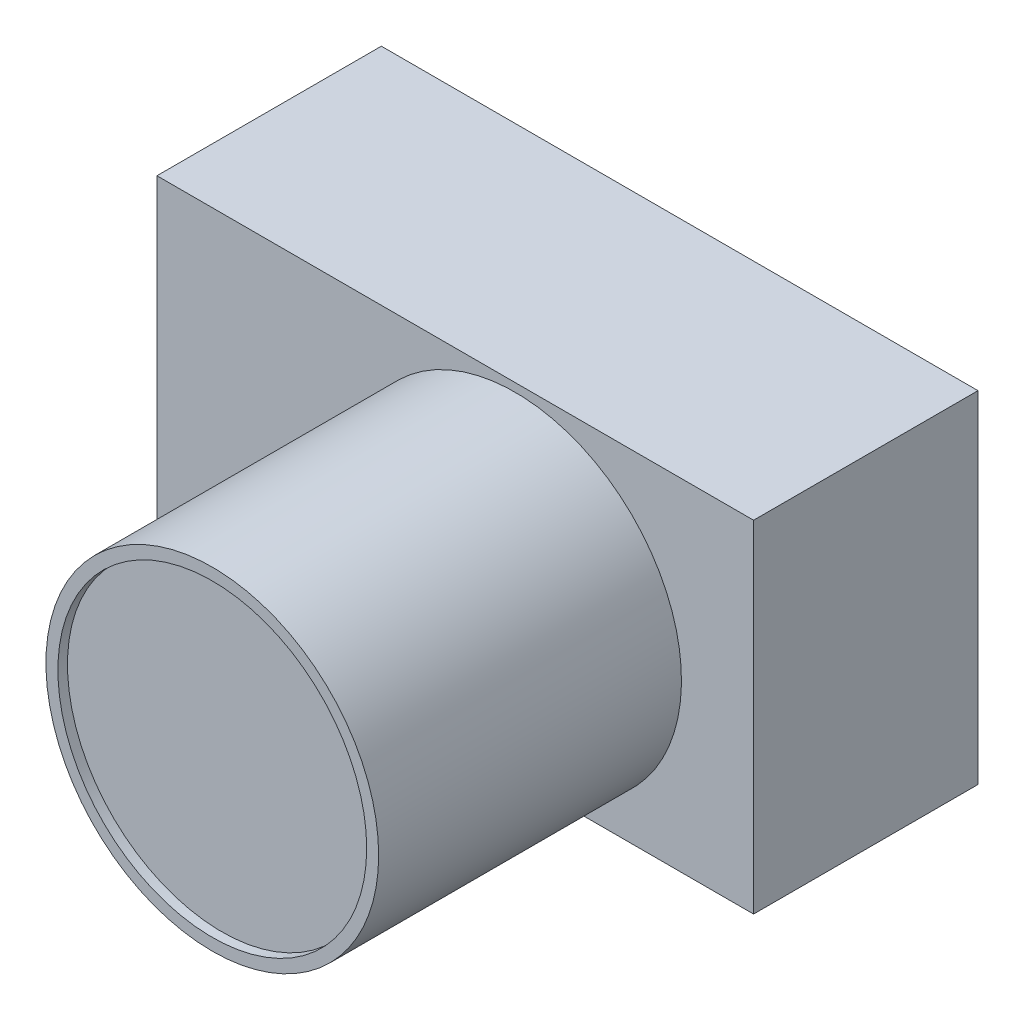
from build123d import *

# Parameters (mm, degrees)
SKETCH1_W           = 126.619
SKETCH1_H           = 72.39
BOSS_EXTRUDE1_DEPTH = 23.8125
SKETCH2_R           = 3.175
CUT_EXTRUDE1_DEPTH  = 6.35
SKETCH3_R           = 35.306
BOSS_EXTRUDE2_DEPTH = 64.262
SKETCH4_R           = 32.766
CUT_EXTRUDE2_DEPTH  = 2.032


with BuildPart() as part:
    # Sketch1 → Boss-Extrude1 (new, symmetric)
    with BuildSketch(Plane.XY):
        Rectangle(SKETCH1_W, SKETCH1_H)
    extrude(amount=BOSS_EXTRUDE1_DEPTH, both=True)

    # Sketch2 → Cut-Extrude1 (cut)
    with BuildSketch(Plane.XZ.offset(36.195)):
        with Locations(Location((12.7, 0, 0), (0, 0, 270))):
            Circle(SKETCH2_R)
    extrude(amount=-CUT_EXTRUDE1_DEPTH, mode=Mode.SUBTRACT)

    # Sketch3 → Boss-Extrude2 (add)
    with BuildSketch(Plane.XY.offset(23.8125)):
        with Locations(Location((12.7, -0.889, 0), (0, 0, 270))):
            Circle(SKETCH3_R)
    extrude(amount=BOSS_EXTRUDE2_DEPTH)

    # Sketch4 → Cut-Extrude2 (cut)
    with BuildSketch(Plane.XY.offset(88.0745)):
        with Locations((12.7, -0.889)):
            Circle(SKETCH4_R)
    extrude(amount=-CUT_EXTRUDE2_DEPTH, mode=Mode.SUBTRACT)


solid = part.part
